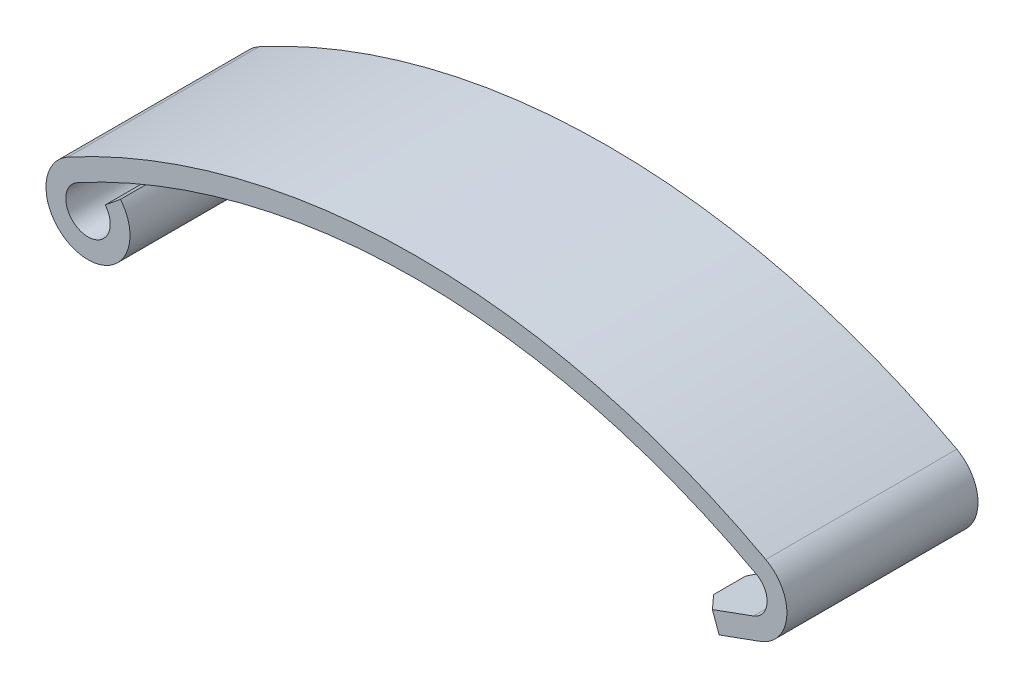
ISO-10303-21;
HEADER;
FILE_DESCRIPTION(('STEP AP214'),'2;1');
FILE_NAME('part.step','',(''),(''),'','','');
FILE_SCHEMA(('AUTOMOTIVE_DESIGN { 1 0 10303 214 1 1 1 1 }'));
ENDSEC;
DATA;
#1=APPLICATION_CONTEXT('core data for automotive mechanical design processes');
#2=APPLICATION_PROTOCOL_DEFINITION('international standard','automotive_design',2000,#1);
#3=PRODUCT_CONTEXT('',#1,'mechanical');
#4=PRODUCT('Part','Part','',(#3));
#5=PRODUCT_RELATED_PRODUCT_CATEGORY('part','',(#4));
#6=PRODUCT_DEFINITION_FORMATION('','',#4);
#7=PRODUCT_DEFINITION_CONTEXT('part definition',#1,'design');
#8=PRODUCT_DEFINITION('design','',#6,#7);
#9=PRODUCT_DEFINITION_SHAPE('','',#8);
#10=(LENGTH_UNIT() NAMED_UNIT(*) SI_UNIT(.MILLI.,.METRE.));
#11=(NAMED_UNIT(*) PLANE_ANGLE_UNIT() SI_UNIT($,.RADIAN.));
#12=(NAMED_UNIT(*) SI_UNIT($,.STERADIAN.) SOLID_ANGLE_UNIT());
#13=UNCERTAINTY_MEASURE_WITH_UNIT(LENGTH_MEASURE(1.E-05),#10,'distance_accuracy_value','');
#14=(GEOMETRIC_REPRESENTATION_CONTEXT(3) GLOBAL_UNCERTAINTY_ASSIGNED_CONTEXT((#13)) GLOBAL_UNIT_ASSIGNED_CONTEXT((#10,
#11,#12)) REPRESENTATION_CONTEXT('',''));
#15=CARTESIAN_POINT('',(0.,0.,0.));
#16=DIRECTION('',(0.,0.,1.));
#17=DIRECTION('',(1.,0.,0.));
#18=AXIS2_PLACEMENT_3D('',#15,#16,#17);
#19=CARTESIAN_POINT('',(-9.58598833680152,10.7779958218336,-4.075));
#20=DIRECTION('',(0.,0.,1.));
#21=DIRECTION('',(1.,0.,0.));
#22=AXIS2_PLACEMENT_3D('',#19,#20,#21);
#23=CYLINDRICAL_SURFACE('',#22,0.964999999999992);
#24=DIRECTION('',(0.,0.,1.));
#25=VECTOR('',#24,1.);
#26=CARTESIAN_POINT('',(-10.0454292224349,11.626605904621,0.0749999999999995));
#27=LINE('',#26,#25);
#28=CARTESIAN_POINT('',(-10.0454292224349,11.626605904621,-4.075));
#29=VERTEX_POINT('',#28);
#30=CARTESIAN_POINT('',(-10.0454292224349,11.626605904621,0.0749999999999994));
#31=VERTEX_POINT('',#30);
#32=EDGE_CURVE('E183',#29,#31,#27,.T.);
#33=ORIENTED_EDGE('',*,*,#32,.T.);
#34=CARTESIAN_POINT('',(-9.58598833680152,10.7779958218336,0.0749999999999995));
#35=DIRECTION('',(0.,0.,1.));
#36=DIRECTION('',(1.,0.,0.));
#37=AXIS2_PLACEMENT_3D('',#34,#35,#36);
#38=CIRCLE('',#37,0.964999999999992);
#39=CARTESIAN_POINT('',(-8.83894753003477,11.3888599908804,0.0749999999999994));
#40=VERTEX_POINT('',#39);
#41=EDGE_CURVE('E11',#31,#40,#38,.T.);
#42=ORIENTED_EDGE('',*,*,#41,.T.);
#43=DIRECTION('',(0.,0.,-1.));
#44=VECTOR('',#43,1.);
#45=CARTESIAN_POINT('',(-8.83894753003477,11.3888599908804,0.0749999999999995));
#46=LINE('',#45,#44);
#47=CARTESIAN_POINT('',(-8.83894753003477,11.3888599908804,-4.075));
#48=VERTEX_POINT('',#47);
#49=EDGE_CURVE('E182',#40,#48,#46,.T.);
#50=ORIENTED_EDGE('',*,*,#49,.T.);
#51=CARTESIAN_POINT('',(-9.58598833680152,10.7779958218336,-4.075));
#52=DIRECTION('',(0.,0.,1.));
#53=DIRECTION('',(1.,0.,0.));
#54=AXIS2_PLACEMENT_3D('',#51,#52,#53);
#55=CIRCLE('',#54,0.964999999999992);
#56=EDGE_CURVE('E222',#29,#48,#55,.T.);
#57=ORIENTED_EDGE('',*,*,#56,.F.);
#58=EDGE_LOOP('',(#33,#42,#50,#57));
#59=FACE_BOUND('',#58,.T.);
#60=ADVANCED_FACE('F36',(#59),#23,.F.);
#61=CARTESIAN_POINT('',(16.690690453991,9.04829170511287,-4.075));
#62=DIRECTION('',(-0.939692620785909,-0.342020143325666,0.));
#63=DIRECTION('',(0.342020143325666,-0.939692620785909,0.));
#64=AXIS2_PLACEMENT_3D('',#61,#62,#63);
#65=PLANE('',#64);
#66=DIRECTION('',(0.,0.,-1.));
#67=VECTOR('',#66,1.);
#68=CARTESIAN_POINT('',(16.9848277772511,8.24015605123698,0.0749999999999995));
#69=LINE('',#68,#67);
#70=CARTESIAN_POINT('',(16.9848277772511,8.24015605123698,3.325));
#71=VERTEX_POINT('',#70);
#72=CARTESIAN_POINT('',(16.9848287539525,8.24015640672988,1.94849856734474));
#73=VERTEX_POINT('',#72);
#74=EDGE_CURVE('E259',#71,#73,#69,.T.);
#75=ORIENTED_EDGE('',*,*,#74,.F.);
#76=DIRECTION('',(0.342020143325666,-0.939692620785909,0.));
#77=VECTOR('',#76,1.);
#78=CARTESIAN_POINT('',(16.8377591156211,8.64422387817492,3.325));
#79=LINE('',#78,#77);
#80=CARTESIAN_POINT('',(16.690690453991,9.04829170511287,3.325));
#81=VERTEX_POINT('',#80);
#82=EDGE_CURVE('E196',#81,#71,#79,.T.);
#83=ORIENTED_EDGE('',*,*,#82,.F.);
#84=DIRECTION('',(0.,0.,1.));
#85=VECTOR('',#84,1.);
#86=CARTESIAN_POINT('',(16.690690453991,9.04829170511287,0.0749999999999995));
#87=LINE('',#86,#85);
#88=CARTESIAN_POINT('',(16.6906904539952,9.04829170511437,1.94849773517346));
#89=VERTEX_POINT('',#88);
#90=EDGE_CURVE('E262',#89,#81,#87,.T.);
#91=ORIENTED_EDGE('',*,*,#90,.F.);
#92=DIRECTION('',(0.342022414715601,-0.939691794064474,0.));
#93=VECTOR('',#92,1.);
#94=CARTESIAN_POINT('',(16.6667482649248,9.11407183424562,1.94849773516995));
#95=LINE('',#94,#93);
#96=EDGE_CURVE('E203',#89,#73,#95,.T.);
#97=ORIENTED_EDGE('',*,*,#96,.T.);
#98=EDGE_LOOP('',(#75,#83,#91,#97));
#99=FACE_BOUND('',#98,.T.);
#100=ADVANCED_FACE('F318',(#99),#65,.T.);
#101=CARTESIAN_POINT('',(15.5752900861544,7.72712242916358,0.0750000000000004));
#102=DIRECTION('',(-0.3420224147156,0.939691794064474,0.));
#103=DIRECTION('',(-0.939691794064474,-0.3420224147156,0.));
#104=AXIS2_PLACEMENT_3D('',#101,#102,#103);
#105=CYLINDRICAL_SURFACE('',#104,2.4);
#106=CARTESIAN_POINT('',(15.5752900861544,7.72712242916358,0.0750000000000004));
#107=DIRECTION('',(-0.3420224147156,0.939691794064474,0.));
#108=DIRECTION('',(-0.939691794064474,-0.3420224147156,0.));
#109=AXIS2_PLACEMENT_3D('',#106,#107,#108);
#110=CIRCLE('',#109,2.4);
#111=CARTESIAN_POINT('',(16.9848277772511,8.24015605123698,-1.79849939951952));
#112=VERTEX_POINT('',#111);
#113=EDGE_CURVE('E161',#73,#112,#110,.T.);
#114=ORIENTED_EDGE('',*,*,#113,.F.);
#115=ORIENTED_EDGE('',*,*,#96,.F.);
#116=CARTESIAN_POINT('',(15.2811508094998,8.53525737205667,0.0750000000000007));
#117=DIRECTION('',(-0.3420224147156,0.939691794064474,0.));
#118=DIRECTION('',(-0.939691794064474,-0.3420224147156,0.));
#119=AXIS2_PLACEMENT_3D('',#116,#117,#118);
#120=CIRCLE('',#119,2.4);
#121=CARTESIAN_POINT('',(16.6906908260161,9.04829068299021,-1.79849856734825));
#122=VERTEX_POINT('',#121);
#123=EDGE_CURVE('E263',#122,#89,#120,.F.);
#124=ORIENTED_EDGE('',*,*,#123,.F.);
#125=DIRECTION('',(-0.342020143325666,0.93969262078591,0.));
#126=VECTOR('',#125,1.);
#127=CARTESIAN_POINT('',(16.8377591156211,8.64422387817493,-1.79849939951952));
#128=LINE('',#127,#126);
#129=EDGE_CURVE('E198',#112,#122,#128,.T.);
#130=ORIENTED_EDGE('',*,*,#129,.F.);
#131=EDGE_LOOP('',(#114,#115,#124,#130));
#132=FACE_BOUND('',#131,.T.);
#133=ADVANCED_FACE('F322',(#132),#105,.F.);
#134=CARTESIAN_POINT('',(16.690690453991,9.04829170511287,-4.075));
#135=DIRECTION('',(-0.939692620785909,-0.342020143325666,0.));
#136=DIRECTION('',(0.342020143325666,-0.939692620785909,0.));
#137=AXIS2_PLACEMENT_3D('',#134,#135,#136);
#138=PLANE('',#137);
#139=DIRECTION('',(0.,0.,1.));
#140=VECTOR('',#139,1.);
#141=CARTESIAN_POINT('',(16.690690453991,9.04829170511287,0.0749999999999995));
#142=LINE('',#141,#140);
#143=CARTESIAN_POINT('',(16.690690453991,9.04829170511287,-3.175));
#144=VERTEX_POINT('',#143);
#145=EDGE_CURVE('E148',#144,#122,#142,.T.);
#146=ORIENTED_EDGE('',*,*,#145,.F.);
#147=DIRECTION('',(-0.342020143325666,0.93969262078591,0.));
#148=VECTOR('',#147,1.);
#149=CARTESIAN_POINT('',(16.8377591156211,8.64422387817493,-3.175));
#150=LINE('',#149,#148);
#151=CARTESIAN_POINT('',(16.9848277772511,8.24015605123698,-3.175));
#152=VERTEX_POINT('',#151);
#153=EDGE_CURVE('E141',#152,#144,#150,.T.);
#154=ORIENTED_EDGE('',*,*,#153,.F.);
#155=DIRECTION('',(0.,0.,-1.));
#156=VECTOR('',#155,1.);
#157=CARTESIAN_POINT('',(16.9848277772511,8.24015605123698,0.0749999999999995));
#158=LINE('',#157,#156);
#159=EDGE_CURVE('E145',#112,#152,#158,.T.);
#160=ORIENTED_EDGE('',*,*,#159,.F.);
#161=ORIENTED_EDGE('',*,*,#129,.T.);
#162=EDGE_LOOP('',(#146,#154,#160,#161));
#163=FACE_BOUND('',#162,.T.);
#164=ADVANCED_FACE('F143',(#163),#138,.T.);
#165=CARTESIAN_POINT('',(-8.17319095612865,11.9332570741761,-4.075));
#166=DIRECTION('',(-0.633019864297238,0.774135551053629,0.));
#167=DIRECTION('',(-0.774135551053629,-0.633019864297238,0.));
#168=AXIS2_PLACEMENT_3D('',#165,#166,#167);
#169=PLANE('',#168);
#170=DIRECTION('',(0.,0.,1.));
#171=VECTOR('',#170,1.);
#172=CARTESIAN_POINT('',(-8.17319095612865,11.9332570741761,0.0749999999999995));
#173=LINE('',#172,#171);
#174=CARTESIAN_POINT('',(-8.17319095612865,11.9332570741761,-4.075));
#175=VERTEX_POINT('',#174);
#176=CARTESIAN_POINT('',(-8.17319095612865,11.9332570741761,4.225));
#177=VERTEX_POINT('',#176);
#178=EDGE_CURVE('E167',#175,#177,#173,.T.);
#179=ORIENTED_EDGE('',*,*,#178,.F.);
#180=DIRECTION('',(-0.774135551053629,-0.633019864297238,0.));
#181=VECTOR('',#180,1.);
#182=CARTESIAN_POINT('',(-8.50606924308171,11.6610585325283,-4.075));
#183=LINE('',#182,#181);
#184=EDGE_CURVE('E193',#175,#48,#183,.T.);
#185=ORIENTED_EDGE('',*,*,#184,.T.);
#186=ORIENTED_EDGE('',*,*,#49,.F.);
#187=CARTESIAN_POINT('',(-8.83894753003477,11.3888599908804,4.225));
#188=VERTEX_POINT('',#187);
#189=EDGE_CURVE('E179',#188,#40,#46,.T.);
#190=ORIENTED_EDGE('',*,*,#189,.F.);
#191=DIRECTION('',(0.774135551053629,0.633019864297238,0.));
#192=VECTOR('',#191,1.);
#193=CARTESIAN_POINT('',(-8.50606924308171,11.6610585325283,4.225));
#194=LINE('',#193,#192);
#195=EDGE_CURVE('E197',#188,#177,#194,.T.);
#196=ORIENTED_EDGE('',*,*,#195,.T.);
#197=EDGE_LOOP('',(#179,#185,#186,#190,#196));
#198=FACE_BOUND('',#197,.T.);
#199=ADVANCED_FACE('F306',(#198),#169,.T.);
#200=CARTESIAN_POINT('',(16.690690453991,9.04829170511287,3.325));
#201=DIRECTION('',(-0.664463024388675,-0.241844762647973,0.707106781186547));
#202=DIRECTION('',(0.342020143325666,-0.939692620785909,0.));
#203=AXIS2_PLACEMENT_3D('',#200,#201,#202);
#204=PLANE('',#203);
#205=DIRECTION('',(0.342020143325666,-0.939692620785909,0.));
#206=VECTOR('',#205,1.);
#207=CARTESIAN_POINT('',(17.5364138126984,9.35610983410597,4.225));
#208=LINE('',#207,#206);
#209=CARTESIAN_POINT('',(17.5364138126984,9.35610983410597,4.225));
#210=VERTEX_POINT('',#209);
#211=CARTESIAN_POINT('',(17.8305503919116,8.54797622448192,4.225));
#212=VERTEX_POINT('',#211);
#213=EDGE_CURVE('E239',#210,#212,#208,.T.);
#214=ORIENTED_EDGE('',*,*,#213,.F.);
#215=DIRECTION('',(0.664463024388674,0.241844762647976,0.707106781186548));
#216=VECTOR('',#215,1.);
#217=CARTESIAN_POINT('',(16.690690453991,9.04829170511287,3.325));
#218=LINE('',#217,#216);
#219=EDGE_CURVE('E189',#81,#210,#218,.T.);
#220=ORIENTED_EDGE('',*,*,#219,.F.);
#221=ORIENTED_EDGE('',*,*,#82,.T.);
#222=DIRECTION('',(-0.664462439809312,-0.241846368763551,-0.707106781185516));
#223=VECTOR('',#222,1.);
#224=CARTESIAN_POINT('',(17.8305503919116,8.54797622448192,4.225));
#225=LINE('',#224,#223);
#226=EDGE_CURVE('E181',#212,#71,#225,.T.);
#227=ORIENTED_EDGE('',*,*,#226,.F.);
#228=EDGE_LOOP('',(#214,#220,#221,#227));
#229=FACE_BOUND('',#228,.T.);
#230=ADVANCED_FACE('F427',(#229),#204,.T.);
#231=CARTESIAN_POINT('',(19.3218297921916,10.0059481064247,-4.075));
#232=DIRECTION('',(-0.342020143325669,0.939692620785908,0.));
#233=DIRECTION('',(-0.939692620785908,-0.342020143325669,0.));
#234=AXIS2_PLACEMENT_3D('',#231,#232,#233);
#235=PLANE('',#234);
#236=DIRECTION('',(0.939692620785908,0.342020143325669,0.));
#237=VECTOR('',#236,1.);
#238=CARTESIAN_POINT('',(17.5364138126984,9.35610983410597,-4.075));
#239=LINE('',#238,#237);
#240=CARTESIAN_POINT('',(17.5364138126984,9.35610983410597,-4.075));
#241=VERTEX_POINT('',#240);
#242=CARTESIAN_POINT('',(19.3218297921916,10.0059481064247,-4.075));
#243=VERTEX_POINT('',#242);
#244=EDGE_CURVE('E231',#241,#243,#239,.T.);
#245=ORIENTED_EDGE('',*,*,#244,.F.);
#246=DIRECTION('',(0.664463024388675,0.241844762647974,-0.707106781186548));
#247=VECTOR('',#246,1.);
#248=CARTESIAN_POINT('',(17.1135521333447,9.20220076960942,-3.625));
#249=LINE('',#248,#247);
#250=EDGE_CURVE('E153',#144,#241,#249,.T.);
#251=ORIENTED_EDGE('',*,*,#250,.F.);
#252=ORIENTED_EDGE('',*,*,#145,.T.);
#253=ORIENTED_EDGE('',*,*,#123,.T.);
#254=ORIENTED_EDGE('',*,*,#90,.T.);
#255=ORIENTED_EDGE('',*,*,#219,.T.);
#256=DIRECTION('',(-0.939692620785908,-0.342020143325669,0.));
#257=VECTOR('',#256,1.);
#258=CARTESIAN_POINT('',(19.3218297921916,10.0059481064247,4.225));
#259=LINE('',#258,#257);
#260=CARTESIAN_POINT('',(19.3218297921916,10.0059481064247,4.225));
#261=VERTEX_POINT('',#260);
#262=EDGE_CURVE('E242',#261,#210,#259,.T.);
#263=ORIENTED_EDGE('',*,*,#262,.F.);
#264=DIRECTION('',(0.,0.,1.));
#265=VECTOR('',#264,1.);
#266=CARTESIAN_POINT('',(19.3218297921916,10.0059481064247,0.0749999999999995));
#267=LINE('',#266,#265);
#268=EDGE_CURVE('E188',#243,#261,#267,.T.);
#269=ORIENTED_EDGE('',*,*,#268,.F.);
#270=EDGE_LOOP('',(#245,#251,#252,#253,#254,#255,#263,#269));
#271=FACE_BOUND('',#270,.T.);
#272=ADVANCED_FACE('F294',(#271),#235,.T.);
#273=CARTESIAN_POINT('',(19.0140116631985,10.8516714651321,-4.075));
#274=DIRECTION('',(0.,0.,1.));
#275=DIRECTION('',(1.,0.,0.));
#276=AXIS2_PLACEMENT_3D('',#273,#274,#275);
#277=CYLINDRICAL_SURFACE('',#276,0.9);
#278=DIRECTION('',(0.,0.,1.));
#279=VECTOR('',#278,1.);
#280=CARTESIAN_POINT('',(19.4415923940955,11.6436150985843,0.0749999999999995));
#281=LINE('',#280,#279);
#282=CARTESIAN_POINT('',(19.4415923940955,11.6436150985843,-4.075));
#283=VERTEX_POINT('',#282);
#284=CARTESIAN_POINT('',(19.4415923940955,11.6436150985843,4.225));
#285=VERTEX_POINT('',#284);
#286=EDGE_CURVE('E186',#283,#285,#281,.T.);
#287=ORIENTED_EDGE('',*,*,#286,.F.);
#288=CARTESIAN_POINT('',(19.0140116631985,10.8516714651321,-4.075));
#289=DIRECTION('',(0.,0.,1.));
#290=DIRECTION('',(1.,0.,0.));
#291=AXIS2_PLACEMENT_3D('',#288,#289,#290);
#292=CIRCLE('',#291,0.9);
#293=EDGE_CURVE('E228',#243,#283,#292,.T.);
#294=ORIENTED_EDGE('',*,*,#293,.F.);
#295=ORIENTED_EDGE('',*,*,#268,.T.);
#296=CARTESIAN_POINT('',(19.0140116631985,10.8516714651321,4.225));
#297=DIRECTION('',(0.,0.,1.));
#298=DIRECTION('',(1.,0.,0.));
#299=AXIS2_PLACEMENT_3D('',#296,#297,#298);
#300=CIRCLE('',#299,0.9);
#301=EDGE_CURVE('E245',#285,#261,#300,.F.);
#302=ORIENTED_EDGE('',*,*,#301,.F.);
#303=EDGE_LOOP('',(#287,#294,#295,#302));
#304=FACE_BOUND('',#303,.T.);
#305=ADVANCED_FACE('F298',(#304),#277,.F.);
#306=CARTESIAN_POINT('',(4.71381166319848,-15.6344433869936,-4.075));
#307=DIRECTION('',(0.,0.,1.));
#308=DIRECTION('',(1.,0.,0.));
#309=AXIS2_PLACEMENT_3D('',#306,#307,#308);
#310=CYLINDRICAL_SURFACE('',#309,30.9999999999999);
#311=ORIENTED_EDGE('',*,*,#32,.F.);
#312=CARTESIAN_POINT('',(4.71381166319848,-15.6344433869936,-4.075));
#313=DIRECTION('',(0.,0.,1.));
#314=DIRECTION('',(1.,0.,0.));
#315=AXIS2_PLACEMENT_3D('',#312,#313,#314);
#316=CIRCLE('',#315,30.9999999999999);
#317=EDGE_CURVE('E225',#283,#29,#316,.T.);
#318=ORIENTED_EDGE('',*,*,#317,.F.);
#319=ORIENTED_EDGE('',*,*,#286,.T.);
#320=CARTESIAN_POINT('',(4.71381166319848,-15.6344433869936,4.225));
#321=DIRECTION('',(0.,0.,1.));
#322=DIRECTION('',(1.,0.,0.));
#323=AXIS2_PLACEMENT_3D('',#320,#321,#322);
#324=CIRCLE('',#323,30.9999999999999);
#325=CARTESIAN_POINT('',(-10.0454292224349,11.626605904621,4.225));
#326=VERTEX_POINT('',#325);
#327=EDGE_CURVE('E248',#326,#285,#324,.F.);
#328=ORIENTED_EDGE('',*,*,#327,.F.);
#329=EDGE_CURVE('E185',#31,#326,#27,.T.);
#330=ORIENTED_EDGE('',*,*,#329,.F.);
#331=EDGE_LOOP('',(#311,#318,#319,#328,#330));
#332=FACE_BOUND('',#331,.T.);
#333=ADVANCED_FACE('F302',(#332),#310,.F.);
#334=ORIENTED_EDGE('',*,*,#41,.F.);
#335=ORIENTED_EDGE('',*,*,#329,.T.);
#336=CARTESIAN_POINT('',(-9.58598833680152,10.7779958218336,4.225));
#337=DIRECTION('',(0.,0.,1.));
#338=DIRECTION('',(1.,0.,0.));
#339=AXIS2_PLACEMENT_3D('',#336,#337,#338);
#340=CIRCLE('',#339,0.964999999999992);
#341=EDGE_CURVE('E251',#188,#326,#340,.F.);
#342=ORIENTED_EDGE('',*,*,#341,.F.);
#343=ORIENTED_EDGE('',*,*,#189,.T.);
#344=EDGE_LOOP('',(#334,#335,#342,#343));
#345=FACE_BOUND('',#344,.T.);
#346=ADVANCED_FACE('F308',(#345),#23,.F.);
#347=CARTESIAN_POINT('',(16.9848277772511,8.24015605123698,-4.075));
#348=DIRECTION('',(0.3420224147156,-0.939691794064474,0.));
#349=DIRECTION('',(0.939691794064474,0.3420224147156,0.));
#350=AXIS2_PLACEMENT_3D('',#347,#348,#349);
#351=PLANE('',#350);
#352=ORIENTED_EDGE('',*,*,#159,.T.);
#353=DIRECTION('',(-0.664463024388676,-0.241844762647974,0.707106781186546));
#354=VECTOR('',#353,1.);
#355=CARTESIAN_POINT('',(17.4076894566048,8.39406511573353,-3.625));
#356=LINE('',#355,#354);
#357=CARTESIAN_POINT('',(17.830550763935,8.547975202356,-4.075));
#358=VERTEX_POINT('',#357);
#359=EDGE_CURVE('E158',#358,#152,#356,.T.);
#360=ORIENTED_EDGE('',*,*,#359,.F.);
#361=DIRECTION('',(-0.939691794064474,-0.342022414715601,0.));
#362=VECTOR('',#361,1.);
#363=CARTESIAN_POINT('',(19.6159720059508,9.19782143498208,-4.075));
#364=LINE('',#363,#362);
#365=CARTESIAN_POINT('',(19.615968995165,9.19781677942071,-4.075));
#366=VERTEX_POINT('',#365);
#367=EDGE_CURVE('E214',#366,#358,#364,.T.);
#368=ORIENTED_EDGE('',*,*,#367,.F.);
#369=DIRECTION('',(0.,0.,1.));
#370=VECTOR('',#369,1.);
#371=CARTESIAN_POINT('',(19.6159648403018,9.19781526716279,-4.075));
#372=LINE('',#371,#370);
#373=CARTESIAN_POINT('',(19.615968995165,9.1978167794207,4.225));
#374=VERTEX_POINT('',#373);
#375=EDGE_CURVE('E234',#374,#366,#372,.F.);
#376=ORIENTED_EDGE('',*,*,#375,.F.);
#377=DIRECTION('',(0.939691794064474,0.3420224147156,0.));
#378=VECTOR('',#377,1.);
#379=CARTESIAN_POINT('',(17.8305503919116,8.54797622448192,4.225));
#380=LINE('',#379,#378);
#381=EDGE_CURVE('E170',#212,#374,#380,.T.);
#382=ORIENTED_EDGE('',*,*,#381,.F.);
#383=ORIENTED_EDGE('',*,*,#226,.T.);
#384=ORIENTED_EDGE('',*,*,#74,.T.);
#385=ORIENTED_EDGE('',*,*,#113,.T.);
#386=EDGE_LOOP('',(#352,#360,#368,#376,#382,#383,#384,#385));
#387=FACE_BOUND('',#386,.T.);
#388=ADVANCED_FACE('F156',(#387),#351,.T.);
#389=CARTESIAN_POINT('',(16.9848277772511,8.24015605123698,-3.175));
#390=DIRECTION('',(-0.664463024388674,-0.241844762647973,-0.707106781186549));
#391=DIRECTION('',(-0.342020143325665,0.939692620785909,0.));
#392=AXIS2_PLACEMENT_3D('',#389,#390,#391);
#393=PLANE('',#392);
#394=DIRECTION('',(-0.342020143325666,0.93969262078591,0.));
#395=VECTOR('',#394,1.);
#396=CARTESIAN_POINT('',(17.8305503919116,8.54797622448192,-4.075));
#397=LINE('',#396,#395);
#398=EDGE_CURVE('E165',#358,#241,#397,.T.);
#399=ORIENTED_EDGE('',*,*,#398,.F.);
#400=ORIENTED_EDGE('',*,*,#359,.T.);
#401=ORIENTED_EDGE('',*,*,#153,.T.);
#402=ORIENTED_EDGE('',*,*,#250,.T.);
#403=EDGE_LOOP('',(#399,#400,#401,#402));
#404=FACE_BOUND('',#403,.T.);
#405=ADVANCED_FACE('F163',(#404),#393,.T.);
#406=CARTESIAN_POINT('',(-9.58598833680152,10.7779958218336,-4.075));
#407=DIRECTION('',(0.,0.,1.));
#408=DIRECTION('',(1.,0.,0.));
#409=AXIS2_PLACEMENT_3D('',#406,#407,#408);
#410=CYLINDRICAL_SURFACE('',#409,1.825);
#411=DIRECTION('',(0.,0.,1.));
#412=VECTOR('',#411,1.);
#413=CARTESIAN_POINT('',(-10.4548791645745,12.3828801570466,0.0749999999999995));
#414=LINE('',#413,#412);
#415=CARTESIAN_POINT('',(-10.4548791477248,12.3828801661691,-4.075));
#416=VERTEX_POINT('',#415);
#417=CARTESIAN_POINT('',(-10.4548791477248,12.3828801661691,4.225));
#418=VERTEX_POINT('',#417);
#419=EDGE_CURVE('E175',#416,#418,#414,.T.);
#420=ORIENTED_EDGE('',*,*,#419,.F.);
#421=CARTESIAN_POINT('',(-9.58598833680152,10.7779958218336,-4.075));
#422=DIRECTION('',(0.,0.,1.));
#423=DIRECTION('',(1.,0.,0.));
#424=AXIS2_PLACEMENT_3D('',#421,#422,#423);
#425=CIRCLE('',#424,1.825);
#426=EDGE_CURVE('E219',#175,#416,#425,.F.);
#427=ORIENTED_EDGE('',*,*,#426,.F.);
#428=ORIENTED_EDGE('',*,*,#178,.T.);
#429=CARTESIAN_POINT('',(-9.58598833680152,10.7779958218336,4.225));
#430=DIRECTION('',(0.,0.,1.));
#431=DIRECTION('',(1.,0.,0.));
#432=AXIS2_PLACEMENT_3D('',#429,#430,#431);
#433=CIRCLE('',#432,1.825);
#434=EDGE_CURVE('E254',#418,#177,#433,.T.);
#435=ORIENTED_EDGE('',*,*,#434,.F.);
#436=EDGE_LOOP('',(#420,#427,#428,#435));
#437=FACE_BOUND('',#436,.T.);
#438=ADVANCED_FACE('F288',(#437),#410,.T.);
#439=CARTESIAN_POINT('',(21.5786354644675,8.04052144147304,4.225));
#440=DIRECTION('',(0.,0.,1.));
#441=DIRECTION('',(0.,1.,0.));
#442=AXIS2_PLACEMENT_3D('',#439,#440,#441);
#443=PLANE('',#442);
#444=ORIENTED_EDGE('',*,*,#262,.T.);
#445=ORIENTED_EDGE('',*,*,#213,.T.);
#446=ORIENTED_EDGE('',*,*,#381,.T.);
#447=CARTESIAN_POINT('',(19.0140036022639,10.8516777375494,4.225));
#448=DIRECTION('',(0.,0.,1.));
#449=DIRECTION('',(1.,0.,0.));
#450=AXIS2_PLACEMENT_3D('',#447,#448,#449);
#451=CIRCLE('',#450,1.76000857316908);
#452=CARTESIAN_POINT('',(19.8556010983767,12.3974279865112,4.225));
#453=VERTEX_POINT('',#452);
#454=EDGE_CURVE('E236',#453,#374,#451,.F.);
#455=ORIENTED_EDGE('',*,*,#454,.F.);
#456=CARTESIAN_POINT('',(4.71381166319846,-15.6344433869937,4.225));
#457=DIRECTION('',(0.,0.,1.));
#458=DIRECTION('',(1.,0.,0.));
#459=AXIS2_PLACEMENT_3D('',#456,#457,#458);
#460=CIRCLE('',#459,31.86);
#461=EDGE_CURVE('E210',#418,#453,#460,.F.);
#462=ORIENTED_EDGE('',*,*,#461,.F.);
#463=ORIENTED_EDGE('',*,*,#434,.T.);
#464=ORIENTED_EDGE('',*,*,#195,.F.);
#465=ORIENTED_EDGE('',*,*,#341,.T.);
#466=ORIENTED_EDGE('',*,*,#327,.T.);
#467=ORIENTED_EDGE('',*,*,#301,.T.);
#468=EDGE_LOOP('',(#444,#445,#446,#455,#462,#463,#464,#465,#466,#467));
#469=FACE_BOUND('',#468,.T.);
#470=ADVANCED_FACE('F290',(#469),#443,.T.);
#471=CARTESIAN_POINT('',(19.0140036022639,10.8516777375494,-4.075));
#472=DIRECTION('',(0.,0.,1.));
#473=DIRECTION('',(1.,0.,0.));
#474=AXIS2_PLACEMENT_3D('',#471,#472,#473);
#475=CYLINDRICAL_SURFACE('',#474,1.76000857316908);
#476=ORIENTED_EDGE('',*,*,#375,.T.);
#477=CARTESIAN_POINT('',(19.0140036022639,10.8516777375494,-4.075));
#478=DIRECTION('',(0.,0.,1.));
#479=DIRECTION('',(1.,0.,0.));
#480=AXIS2_PLACEMENT_3D('',#477,#478,#479);
#481=CIRCLE('',#480,1.76000857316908);
#482=CARTESIAN_POINT('',(19.8556010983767,12.3974279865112,-4.075));
#483=VERTEX_POINT('',#482);
#484=EDGE_CURVE('E216',#483,#366,#481,.F.);
#485=ORIENTED_EDGE('',*,*,#484,.F.);
#486=DIRECTION('',(0.,0.,-1.));
#487=VECTOR('',#486,1.);
#488=CARTESIAN_POINT('',(19.8556010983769,12.3974279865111,0.0749999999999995));
#489=LINE('',#488,#487);
#490=EDGE_CURVE('E209',#453,#483,#489,.T.);
#491=ORIENTED_EDGE('',*,*,#490,.F.);
#492=ORIENTED_EDGE('',*,*,#454,.T.);
#493=EDGE_LOOP('',(#476,#485,#491,#492));
#494=FACE_BOUND('',#493,.T.);
#495=ADVANCED_FACE('F281',(#494),#475,.T.);
#496=CARTESIAN_POINT('',(-12.215613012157,16.425190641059,-4.075));
#497=DIRECTION('',(0.,0.,-1.));
#498=DIRECTION('',(1.,0.,0.));
#499=AXIS2_PLACEMENT_3D('',#496,#497,#498);
#500=PLANE('',#499);
#501=ORIENTED_EDGE('',*,*,#367,.T.);
#502=ORIENTED_EDGE('',*,*,#398,.T.);
#503=ORIENTED_EDGE('',*,*,#244,.T.);
#504=ORIENTED_EDGE('',*,*,#293,.T.);
#505=ORIENTED_EDGE('',*,*,#317,.T.);
#506=ORIENTED_EDGE('',*,*,#56,.T.);
#507=ORIENTED_EDGE('',*,*,#184,.F.);
#508=ORIENTED_EDGE('',*,*,#426,.T.);
#509=CARTESIAN_POINT('',(4.71381166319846,-15.6344433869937,-4.075));
#510=DIRECTION('',(0.,0.,1.));
#511=DIRECTION('',(1.,0.,0.));
#512=AXIS2_PLACEMENT_3D('',#509,#510,#511);
#513=CIRCLE('',#512,31.86);
#514=EDGE_CURVE('E45',#483,#416,#513,.T.);
#515=ORIENTED_EDGE('',*,*,#514,.F.);
#516=ORIENTED_EDGE('',*,*,#484,.T.);
#517=EDGE_LOOP('',(#501,#502,#503,#504,#505,#506,#507,#508,#515,#516));
#518=FACE_BOUND('',#517,.T.);
#519=ADVANCED_FACE('F284',(#518),#500,.T.);
#520=CARTESIAN_POINT('',(4.71381166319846,-15.6344433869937,-4.075));
#521=DIRECTION('',(0.,0.,1.));
#522=DIRECTION('',(1.,0.,0.));
#523=AXIS2_PLACEMENT_3D('',#520,#521,#522);
#524=CYLINDRICAL_SURFACE('',#523,31.86);
#525=ORIENTED_EDGE('',*,*,#490,.T.);
#526=ORIENTED_EDGE('',*,*,#514,.T.);
#527=ORIENTED_EDGE('',*,*,#419,.T.);
#528=ORIENTED_EDGE('',*,*,#461,.T.);
#529=EDGE_LOOP('',(#525,#526,#527,#528));
#530=FACE_BOUND('',#529,.T.);
#531=ADVANCED_FACE('F38',(#530),#524,.T.);
#532=CLOSED_SHELL('',(#60,#100,#133,#164,#199,#230,#272,#305,#333,#346,#388,#405,#438,#470,#495,
#519,#531));
#533=MANIFOLD_SOLID_BREP('B2',#532);
#534=ADVANCED_BREP_SHAPE_REPRESENTATION('',(#18,#533),#14);
#535=SHAPE_DEFINITION_REPRESENTATION(#9,#534);
ENDSEC;
END-ISO-10303-21;
